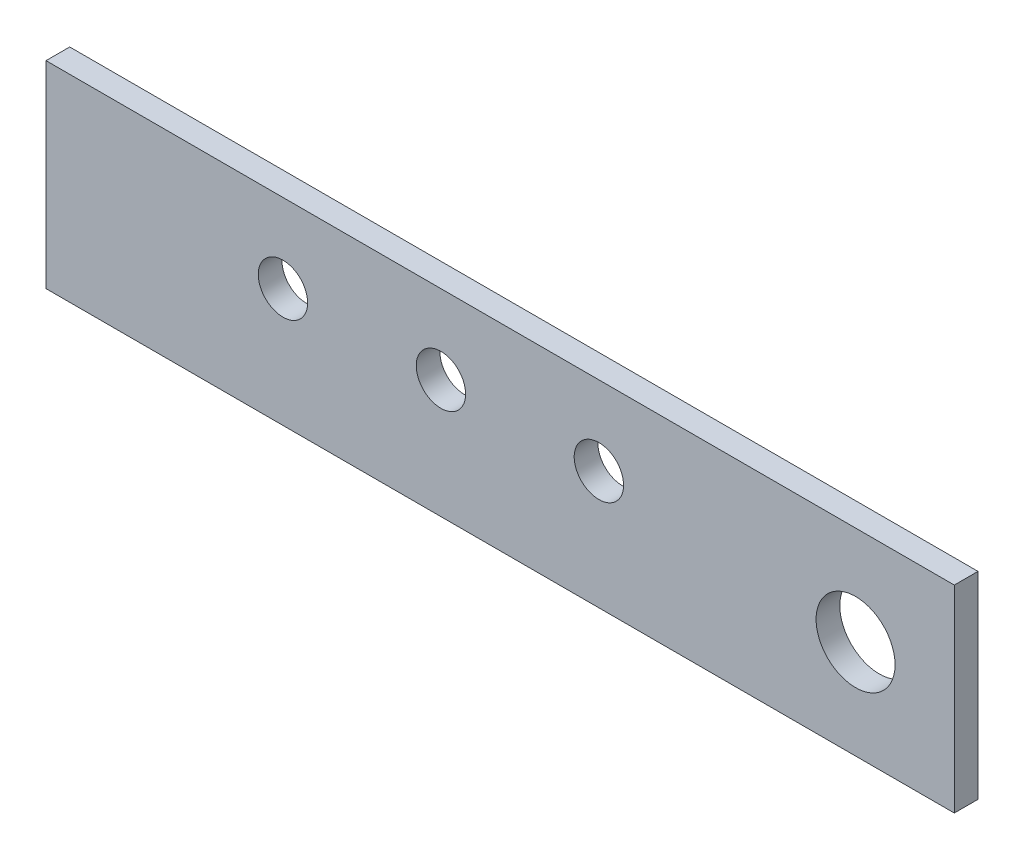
ISO-10303-21;
HEADER;
FILE_DESCRIPTION(('STEP AP214'),'2;1');
FILE_NAME('part.step','',(''),(''),'','','');
FILE_SCHEMA(('AUTOMOTIVE_DESIGN { 1 0 10303 214 1 1 1 1 }'));
ENDSEC;
DATA;
#1=APPLICATION_CONTEXT('core data for automotive mechanical design processes');
#2=APPLICATION_PROTOCOL_DEFINITION('international standard','automotive_design',2000,#1);
#3=PRODUCT_CONTEXT('',#1,'mechanical');
#4=PRODUCT('Part','Part','',(#3));
#5=PRODUCT_RELATED_PRODUCT_CATEGORY('part','',(#4));
#6=PRODUCT_DEFINITION_FORMATION('','',#4);
#7=PRODUCT_DEFINITION_CONTEXT('part definition',#1,'design');
#8=PRODUCT_DEFINITION('design','',#6,#7);
#9=PRODUCT_DEFINITION_SHAPE('','',#8);
#10=(LENGTH_UNIT() NAMED_UNIT(*) SI_UNIT(.MILLI.,.METRE.));
#11=(NAMED_UNIT(*) PLANE_ANGLE_UNIT() SI_UNIT($,.RADIAN.));
#12=(NAMED_UNIT(*) SI_UNIT($,.STERADIAN.) SOLID_ANGLE_UNIT());
#13=UNCERTAINTY_MEASURE_WITH_UNIT(LENGTH_MEASURE(1.E-05),#10,'distance_accuracy_value','');
#14=(GEOMETRIC_REPRESENTATION_CONTEXT(3) GLOBAL_UNCERTAINTY_ASSIGNED_CONTEXT((#13)) GLOBAL_UNIT_ASSIGNED_CONTEXT((#10,
#11,#12)) REPRESENTATION_CONTEXT('',''));
#15=CARTESIAN_POINT('',(0.,0.,0.));
#16=DIRECTION('',(0.,0.,1.));
#17=DIRECTION('',(1.,0.,0.));
#18=AXIS2_PLACEMENT_3D('',#15,#16,#17);
#19=CARTESIAN_POINT('',(0.,-100.,12.));
#20=DIRECTION('',(0.,0.,1.));
#21=DIRECTION('',(1.,0.,0.));
#22=AXIS2_PLACEMENT_3D('',#19,#20,#21);
#23=PLANE('',#22);
#24=CARTESIAN_POINT('',(200.,-40.,12.));
#25=DIRECTION('',(0.,0.,1.));
#26=DIRECTION('',(1.,0.,0.));
#27=AXIS2_PLACEMENT_3D('',#24,#25,#26);
#28=CIRCLE('',#27,12.5);
#29=CARTESIAN_POINT('',(212.5,-40.,12.));
#30=VERTEX_POINT('',#29);
#31=EDGE_CURVE('E133',#30,#30,#28,.T.);
#32=ORIENTED_EDGE('',*,*,#31,.F.);
#33=EDGE_LOOP('',(#32));
#34=FACE_BOUND('',#33,.T.);
#35=CARTESIAN_POINT('',(410.,-50.,12.));
#36=DIRECTION('',(0.,0.,1.));
#37=DIRECTION('',(1.,0.,0.));
#38=AXIS2_PLACEMENT_3D('',#35,#36,#37);
#39=CIRCLE('',#38,20.);
#40=CARTESIAN_POINT('',(430.,-50.,12.));
#41=VERTEX_POINT('',#40);
#42=EDGE_CURVE('E92',#41,#41,#39,.T.);
#43=ORIENTED_EDGE('',*,*,#42,.F.);
#44=EDGE_LOOP('',(#43));
#45=FACE_BOUND('',#44,.T.);
#46=DIRECTION('',(0.,-1.,0.));
#47=VECTOR('',#46,1.);
#48=CARTESIAN_POINT('',(0.,0.,12.));
#49=LINE('',#48,#47);
#50=CARTESIAN_POINT('',(0.,0.,12.));
#51=VERTEX_POINT('',#50);
#52=CARTESIAN_POINT('',(0.,-100.,12.));
#53=VERTEX_POINT('',#52);
#54=EDGE_CURVE('E102',#51,#53,#49,.T.);
#55=ORIENTED_EDGE('',*,*,#54,.T.);
#56=DIRECTION('',(1.,0.,0.));
#57=VECTOR('',#56,1.);
#58=CARTESIAN_POINT('',(0.,-100.,12.));
#59=LINE('',#58,#57);
#60=CARTESIAN_POINT('',(460.,-100.,12.));
#61=VERTEX_POINT('',#60);
#62=EDGE_CURVE('E87',#53,#61,#59,.T.);
#63=ORIENTED_EDGE('',*,*,#62,.T.);
#64=DIRECTION('',(0.,1.,0.));
#65=VECTOR('',#64,1.);
#66=CARTESIAN_POINT('',(460.,0.,12.));
#67=LINE('',#66,#65);
#68=CARTESIAN_POINT('',(460.,0.,12.));
#69=VERTEX_POINT('',#68);
#70=EDGE_CURVE('E53',#61,#69,#67,.T.);
#71=ORIENTED_EDGE('',*,*,#70,.T.);
#72=DIRECTION('',(-1.,0.,0.));
#73=VECTOR('',#72,1.);
#74=CARTESIAN_POINT('',(0.,0.,12.));
#75=LINE('',#74,#73);
#76=EDGE_CURVE('E48',#69,#51,#75,.T.);
#77=ORIENTED_EDGE('',*,*,#76,.T.);
#78=EDGE_LOOP('',(#55,#63,#71,#77));
#79=FACE_BOUND('',#78,.T.);
#80=CARTESIAN_POINT('',(120.,-40.,12.));
#81=DIRECTION('',(0.,0.,1.));
#82=DIRECTION('',(1.,0.,0.));
#83=AXIS2_PLACEMENT_3D('',#80,#81,#82);
#84=CIRCLE('',#83,12.5);
#85=CARTESIAN_POINT('',(132.5,-40.,12.));
#86=VERTEX_POINT('',#85);
#87=EDGE_CURVE('E124',#86,#86,#84,.T.);
#88=ORIENTED_EDGE('',*,*,#87,.F.);
#89=EDGE_LOOP('',(#88));
#90=FACE_BOUND('',#89,.T.);
#91=CARTESIAN_POINT('',(280.,-40.,12.));
#92=DIRECTION('',(0.,0.,1.));
#93=DIRECTION('',(1.,0.,0.));
#94=AXIS2_PLACEMENT_3D('',#91,#92,#93);
#95=CIRCLE('',#94,12.5);
#96=CARTESIAN_POINT('',(292.5,-40.,12.));
#97=VERTEX_POINT('',#96);
#98=EDGE_CURVE('E127',#97,#97,#95,.T.);
#99=ORIENTED_EDGE('',*,*,#98,.F.);
#100=EDGE_LOOP('',(#99));
#101=FACE_BOUND('',#100,.T.);
#102=ADVANCED_FACE('F33',(#34,#45,#79,#90,#101),#23,.T.);
#103=CARTESIAN_POINT('',(0.,-100.,0.));
#104=DIRECTION('',(0.,0.,1.));
#105=DIRECTION('',(1.,0.,0.));
#106=AXIS2_PLACEMENT_3D('',#103,#104,#105);
#107=PLANE('',#106);
#108=CARTESIAN_POINT('',(200.,-40.,0.));
#109=DIRECTION('',(0.,0.,1.));
#110=DIRECTION('',(1.,0.,0.));
#111=AXIS2_PLACEMENT_3D('',#108,#109,#110);
#112=CIRCLE('',#111,12.5);
#113=CARTESIAN_POINT('',(212.5,-40.,0.));
#114=VERTEX_POINT('',#113);
#115=EDGE_CURVE('E129',#114,#114,#112,.T.);
#116=ORIENTED_EDGE('',*,*,#115,.T.);
#117=EDGE_LOOP('',(#116));
#118=FACE_BOUND('',#117,.T.);
#119=CARTESIAN_POINT('',(410.,-50.,0.));
#120=DIRECTION('',(0.,0.,1.));
#121=DIRECTION('',(1.,0.,0.));
#122=AXIS2_PLACEMENT_3D('',#119,#120,#121);
#123=CIRCLE('',#122,20.);
#124=CARTESIAN_POINT('',(430.,-50.,0.));
#125=VERTEX_POINT('',#124);
#126=EDGE_CURVE('E95',#125,#125,#123,.T.);
#127=ORIENTED_EDGE('',*,*,#126,.T.);
#128=EDGE_LOOP('',(#127));
#129=FACE_BOUND('',#128,.T.);
#130=DIRECTION('',(0.,-1.,0.));
#131=VECTOR('',#130,1.);
#132=CARTESIAN_POINT('',(0.,0.,0.));
#133=LINE('',#132,#131);
#134=CARTESIAN_POINT('',(0.,0.,0.));
#135=VERTEX_POINT('',#134);
#136=CARTESIAN_POINT('',(0.,-100.,0.));
#137=VERTEX_POINT('',#136);
#138=EDGE_CURVE('E79',#135,#137,#133,.T.);
#139=ORIENTED_EDGE('',*,*,#138,.F.);
#140=DIRECTION('',(-1.,0.,0.));
#141=VECTOR('',#140,1.);
#142=CARTESIAN_POINT('',(0.,0.,0.));
#143=LINE('',#142,#141);
#144=CARTESIAN_POINT('',(460.,0.,0.));
#145=VERTEX_POINT('',#144);
#146=EDGE_CURVE('E100',#145,#135,#143,.T.);
#147=ORIENTED_EDGE('',*,*,#146,.F.);
#148=DIRECTION('',(0.,1.,0.));
#149=VECTOR('',#148,1.);
#150=CARTESIAN_POINT('',(460.,0.,0.));
#151=LINE('',#150,#149);
#152=CARTESIAN_POINT('',(460.,-100.,0.));
#153=VERTEX_POINT('',#152);
#154=EDGE_CURVE('E80',#153,#145,#151,.T.);
#155=ORIENTED_EDGE('',*,*,#154,.F.);
#156=DIRECTION('',(1.,0.,0.));
#157=VECTOR('',#156,1.);
#158=CARTESIAN_POINT('',(0.,-100.,0.));
#159=LINE('',#158,#157);
#160=EDGE_CURVE('E74',#137,#153,#159,.T.);
#161=ORIENTED_EDGE('',*,*,#160,.F.);
#162=EDGE_LOOP('',(#139,#147,#155,#161));
#163=FACE_BOUND('',#162,.T.);
#164=CARTESIAN_POINT('',(120.,-40.,0.));
#165=DIRECTION('',(0.,0.,1.));
#166=DIRECTION('',(1.,0.,0.));
#167=AXIS2_PLACEMENT_3D('',#164,#165,#166);
#168=CIRCLE('',#167,12.5);
#169=CARTESIAN_POINT('',(132.5,-40.,0.));
#170=VERTEX_POINT('',#169);
#171=EDGE_CURVE('E140',#170,#170,#168,.T.);
#172=ORIENTED_EDGE('',*,*,#171,.T.);
#173=EDGE_LOOP('',(#172));
#174=FACE_BOUND('',#173,.T.);
#175=CARTESIAN_POINT('',(280.,-40.,0.));
#176=DIRECTION('',(0.,0.,1.));
#177=DIRECTION('',(1.,0.,0.));
#178=AXIS2_PLACEMENT_3D('',#175,#176,#177);
#179=CIRCLE('',#178,12.5);
#180=CARTESIAN_POINT('',(292.5,-40.,0.));
#181=VERTEX_POINT('',#180);
#182=EDGE_CURVE('E130',#181,#181,#179,.T.);
#183=ORIENTED_EDGE('',*,*,#182,.T.);
#184=EDGE_LOOP('',(#183));
#185=FACE_BOUND('',#184,.T.);
#186=ADVANCED_FACE('F75',(#118,#129,#163,#174,#185),#107,.F.);
#187=CARTESIAN_POINT('',(0.,0.,12.));
#188=DIRECTION('',(1.,0.,0.));
#189=DIRECTION('',(0.,1.,0.));
#190=AXIS2_PLACEMENT_3D('',#187,#188,#189);
#191=PLANE('',#190);
#192=ORIENTED_EDGE('',*,*,#138,.T.);
#193=DIRECTION('',(0.,0.,-1.));
#194=VECTOR('',#193,1.);
#195=CARTESIAN_POINT('',(0.,-100.,12.));
#196=LINE('',#195,#194);
#197=EDGE_CURVE('E11',#53,#137,#196,.T.);
#198=ORIENTED_EDGE('',*,*,#197,.F.);
#199=ORIENTED_EDGE('',*,*,#54,.F.);
#200=DIRECTION('',(0.,0.,-1.));
#201=VECTOR('',#200,1.);
#202=CARTESIAN_POINT('',(0.,0.,12.));
#203=LINE('',#202,#201);
#204=EDGE_CURVE('E91',#51,#135,#203,.T.);
#205=ORIENTED_EDGE('',*,*,#204,.T.);
#206=EDGE_LOOP('',(#192,#198,#199,#205));
#207=FACE_BOUND('',#206,.T.);
#208=ADVANCED_FACE('F35',(#207),#191,.F.);
#209=CARTESIAN_POINT('',(0.,-100.,12.));
#210=DIRECTION('',(0.,1.,0.));
#211=DIRECTION('',(0.,0.,1.));
#212=AXIS2_PLACEMENT_3D('',#209,#210,#211);
#213=PLANE('',#212);
#214=ORIENTED_EDGE('',*,*,#160,.T.);
#215=DIRECTION('',(0.,0.,-1.));
#216=VECTOR('',#215,1.);
#217=CARTESIAN_POINT('',(460.,-100.,12.));
#218=LINE('',#217,#216);
#219=EDGE_CURVE('E41',#61,#153,#218,.T.);
#220=ORIENTED_EDGE('',*,*,#219,.F.);
#221=ORIENTED_EDGE('',*,*,#62,.F.);
#222=ORIENTED_EDGE('',*,*,#197,.T.);
#223=EDGE_LOOP('',(#214,#220,#221,#222));
#224=FACE_BOUND('',#223,.T.);
#225=ADVANCED_FACE('F86',(#224),#213,.F.);
#226=CARTESIAN_POINT('',(460.,0.,12.));
#227=DIRECTION('',(-1.,0.,0.));
#228=DIRECTION('',(0.,0.,1.));
#229=AXIS2_PLACEMENT_3D('',#226,#227,#228);
#230=PLANE('',#229);
#231=ORIENTED_EDGE('',*,*,#154,.T.);
#232=DIRECTION('',(0.,0.,-1.));
#233=VECTOR('',#232,1.);
#234=CARTESIAN_POINT('',(460.,0.,12.));
#235=LINE('',#234,#233);
#236=EDGE_CURVE('E110',#69,#145,#235,.T.);
#237=ORIENTED_EDGE('',*,*,#236,.F.);
#238=ORIENTED_EDGE('',*,*,#70,.F.);
#239=ORIENTED_EDGE('',*,*,#219,.T.);
#240=EDGE_LOOP('',(#231,#237,#238,#239));
#241=FACE_BOUND('',#240,.T.);
#242=ADVANCED_FACE('F114',(#241),#230,.F.);
#243=CARTESIAN_POINT('',(0.,0.,12.));
#244=DIRECTION('',(0.,-1.,0.));
#245=DIRECTION('',(0.,0.,-1.));
#246=AXIS2_PLACEMENT_3D('',#243,#244,#245);
#247=PLANE('',#246);
#248=ORIENTED_EDGE('',*,*,#146,.T.);
#249=ORIENTED_EDGE('',*,*,#204,.F.);
#250=ORIENTED_EDGE('',*,*,#76,.F.);
#251=ORIENTED_EDGE('',*,*,#236,.T.);
#252=EDGE_LOOP('',(#248,#249,#250,#251));
#253=FACE_BOUND('',#252,.T.);
#254=ADVANCED_FACE('F116',(#253),#247,.F.);
#255=CARTESIAN_POINT('',(410.,-50.,12.));
#256=DIRECTION('',(0.,0.,-1.));
#257=DIRECTION('',(-1.,0.,0.));
#258=AXIS2_PLACEMENT_3D('',#255,#256,#257);
#259=CYLINDRICAL_SURFACE('',#258,20.);
#260=ORIENTED_EDGE('',*,*,#42,.T.);
#261=EDGE_LOOP('',(#260));
#262=FACE_BOUND('',#261,.T.);
#263=ORIENTED_EDGE('',*,*,#126,.F.);
#264=EDGE_LOOP('',(#263));
#265=FACE_BOUND('',#264,.T.);
#266=ADVANCED_FACE('F147',(#262,#265),#259,.F.);
#267=CARTESIAN_POINT('',(120.,-40.,12.));
#268=DIRECTION('',(0.,0.,-1.));
#269=DIRECTION('',(-1.,0.,0.));
#270=AXIS2_PLACEMENT_3D('',#267,#268,#269);
#271=CYLINDRICAL_SURFACE('',#270,12.5);
#272=ORIENTED_EDGE('',*,*,#87,.T.);
#273=EDGE_LOOP('',(#272));
#274=FACE_BOUND('',#273,.T.);
#275=ORIENTED_EDGE('',*,*,#171,.F.);
#276=EDGE_LOOP('',(#275));
#277=FACE_BOUND('',#276,.T.);
#278=ADVANCED_FACE('F149',(#274,#277),#271,.F.);
#279=CARTESIAN_POINT('',(200.,-40.,12.));
#280=DIRECTION('',(0.,0.,-1.));
#281=DIRECTION('',(-1.,0.,0.));
#282=AXIS2_PLACEMENT_3D('',#279,#280,#281);
#283=CYLINDRICAL_SURFACE('',#282,12.5);
#284=ORIENTED_EDGE('',*,*,#31,.T.);
#285=EDGE_LOOP('',(#284));
#286=FACE_BOUND('',#285,.T.);
#287=ORIENTED_EDGE('',*,*,#115,.F.);
#288=EDGE_LOOP('',(#287));
#289=FACE_BOUND('',#288,.T.);
#290=ADVANCED_FACE('F156',(#286,#289),#283,.F.);
#291=CARTESIAN_POINT('',(280.,-40.,12.));
#292=DIRECTION('',(0.,0.,-1.));
#293=DIRECTION('',(-1.,0.,0.));
#294=AXIS2_PLACEMENT_3D('',#291,#292,#293);
#295=CYLINDRICAL_SURFACE('',#294,12.5);
#296=ORIENTED_EDGE('',*,*,#98,.T.);
#297=EDGE_LOOP('',(#296));
#298=FACE_BOUND('',#297,.T.);
#299=ORIENTED_EDGE('',*,*,#182,.F.);
#300=EDGE_LOOP('',(#299));
#301=FACE_BOUND('',#300,.T.);
#302=ADVANCED_FACE('F218',(#298,#301),#295,.F.);
#303=CLOSED_SHELL('',(#102,#186,#208,#225,#242,#254,#266,#278,#290,#302));
#304=MANIFOLD_SOLID_BREP('B2',#303);
#305=ADVANCED_BREP_SHAPE_REPRESENTATION('',(#18,#304),#14);
#306=SHAPE_DEFINITION_REPRESENTATION(#9,#305);
ENDSEC;
END-ISO-10303-21;
